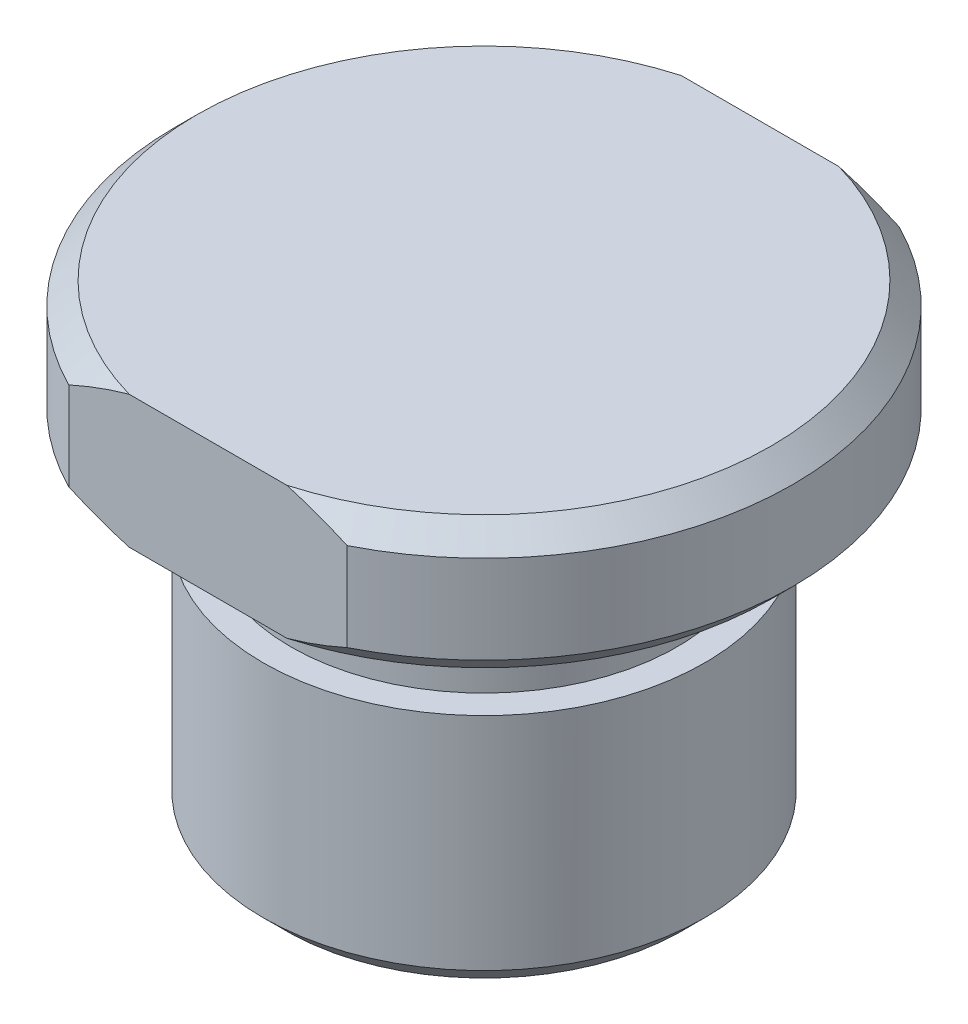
ISO-10303-21;
HEADER;
FILE_DESCRIPTION(('STEP AP214'),'2;1');
FILE_NAME('part.step','',(''),(''),'','','');
FILE_SCHEMA(('AUTOMOTIVE_DESIGN { 1 0 10303 214 1 1 1 1 }'));
ENDSEC;
DATA;
#1=APPLICATION_CONTEXT('core data for automotive mechanical design processes');
#2=APPLICATION_PROTOCOL_DEFINITION('international standard','automotive_design',2000,#1);
#3=PRODUCT_CONTEXT('',#1,'mechanical');
#4=PRODUCT('Part','Part','',(#3));
#5=PRODUCT_RELATED_PRODUCT_CATEGORY('part','',(#4));
#6=PRODUCT_DEFINITION_FORMATION('','',#4);
#7=PRODUCT_DEFINITION_CONTEXT('part definition',#1,'design');
#8=PRODUCT_DEFINITION('design','',#6,#7);
#9=PRODUCT_DEFINITION_SHAPE('','',#8);
#10=(LENGTH_UNIT() NAMED_UNIT(*) SI_UNIT(.MILLI.,.METRE.));
#11=(NAMED_UNIT(*) PLANE_ANGLE_UNIT() SI_UNIT($,.RADIAN.));
#12=(NAMED_UNIT(*) SI_UNIT($,.STERADIAN.) SOLID_ANGLE_UNIT());
#13=UNCERTAINTY_MEASURE_WITH_UNIT(LENGTH_MEASURE(1.E-05),#10,'distance_accuracy_value','');
#14=(GEOMETRIC_REPRESENTATION_CONTEXT(3) GLOBAL_UNCERTAINTY_ASSIGNED_CONTEXT((#13)) GLOBAL_UNIT_ASSIGNED_CONTEXT((#10,
#11,#12)) REPRESENTATION_CONTEXT('',''));
#15=CARTESIAN_POINT('',(0.,0.,0.));
#16=DIRECTION('',(0.,0.,1.));
#17=DIRECTION('',(1.,0.,0.));
#18=AXIS2_PLACEMENT_3D('',#15,#16,#17);
#19=CARTESIAN_POINT('',(0.,19.2193593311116,0.));
#20=DIRECTION('',(0.,1.,0.));
#21=DIRECTION('',(0.,0.,1.));
#22=AXIS2_PLACEMENT_3D('',#19,#20,#21);
#23=CYLINDRICAL_SURFACE('',#22,14.);
#24=DIRECTION('',(0.,1.,0.));
#25=VECTOR('',#24,1.);
#26=CARTESIAN_POINT('',(-6.30476010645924,-15.,-12.5));
#27=LINE('',#26,#25);
#28=CARTESIAN_POINT('',(-6.30476010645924,1.,-12.5));
#29=VERTEX_POINT('',#28);
#30=CARTESIAN_POINT('',(-6.30476010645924,5.,-12.5));
#31=VERTEX_POINT('',#30);
#32=EDGE_CURVE('E520',#29,#31,#27,.T.);
#33=ORIENTED_EDGE('',*,*,#32,.F.);
#34=CARTESIAN_POINT('',(0.,1.,0.));
#35=DIRECTION('',(0.,-1.,0.));
#36=DIRECTION('',(0.,0.,-1.));
#37=AXIS2_PLACEMENT_3D('',#34,#35,#36);
#38=CIRCLE('',#37,14.);
#39=CARTESIAN_POINT('',(-6.30476010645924,1.,12.5));
#40=VERTEX_POINT('',#39);
#41=EDGE_CURVE('E605',#29,#40,#38,.F.);
#42=ORIENTED_EDGE('',*,*,#41,.T.);
#43=DIRECTION('',(0.,1.,0.));
#44=VECTOR('',#43,1.);
#45=CARTESIAN_POINT('',(-6.30476010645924,-15.,12.5));
#46=LINE('',#45,#44);
#47=CARTESIAN_POINT('',(-6.30476010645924,5.,12.5));
#48=VERTEX_POINT('',#47);
#49=EDGE_CURVE('E560',#40,#48,#46,.T.);
#50=ORIENTED_EDGE('',*,*,#49,.T.);
#51=CARTESIAN_POINT('',(0.,4.99999999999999,0.));
#52=DIRECTION('',(0.,1.,0.));
#53=DIRECTION('',(0.,0.,1.));
#54=AXIS2_PLACEMENT_3D('',#51,#52,#53);
#55=CIRCLE('',#54,14.);
#56=EDGE_CURVE('E606',#48,#31,#55,.F.);
#57=ORIENTED_EDGE('',*,*,#56,.T.);
#58=EDGE_LOOP('',(#33,#42,#50,#57));
#59=FACE_BOUND('',#58,.T.);
#60=ADVANCED_FACE('F450',(#59),#23,.T.);
#61=CARTESIAN_POINT('',(0.,1.,0.));
#62=DIRECTION('',(0.,1.,0.));
#63=DIRECTION('',(0.,0.,1.));
#64=AXIS2_PLACEMENT_3D('',#61,#62,#63);
#65=CONICAL_SURFACE('',#64,14.,0.78539816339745);
#66=CARTESIAN_POINT('',(13.8944264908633,5.68970538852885,-12.5));
#67=CARTESIAN_POINT('',(13.7152136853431,5.55647654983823,-12.5));
#68=CARTESIAN_POINT('',(13.5354519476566,5.42398672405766,-12.5));
#69=CARTESIAN_POINT('',(13.1747372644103,5.1606303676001,-12.5));
#70=CARTESIAN_POINT('',(12.9937842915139,5.02976387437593,-12.5));
#71=CARTESIAN_POINT('',(12.4489023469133,4.63974875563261,-12.5));
#72=CARTESIAN_POINT('',(12.0830573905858,4.38326432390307,-12.5));
#73=CARTESIAN_POINT('',(11.3417667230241,3.87636756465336,-12.5));
#74=CARTESIAN_POINT('',(10.9662615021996,3.62604203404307,-12.5));
#75=CARTESIAN_POINT('',(10.2083070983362,3.13616722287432,-12.5));
#76=CARTESIAN_POINT('',(9.82585852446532,2.89661700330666,-12.5));
#77=CARTESIAN_POINT('',(9.03270264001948,2.41863588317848,-12.5));
#78=CARTESIAN_POINT('',(8.6215631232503,2.18091791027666,-12.5));
#79=CARTESIAN_POINT('',(7.78893953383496,1.72400806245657,-12.5));
#80=CARTESIAN_POINT('',(7.3674534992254,1.50481973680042,-12.5));
#81=CARTESIAN_POINT('',(6.51460488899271,1.09083627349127,-12.5));
#82=CARTESIAN_POINT('',(6.08328777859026,0.895948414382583,-12.5));
#83=CARTESIAN_POINT('',(5.20856500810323,0.535893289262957,-12.5));
#84=CARTESIAN_POINT('',(4.76516637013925,0.370709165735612,-12.5));
#85=CARTESIAN_POINT('',(3.89303118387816,0.0861177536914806,-12.5));
#86=CARTESIAN_POINT('',(3.46501191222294,-0.0354419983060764,-12.5));
#87=CARTESIAN_POINT('',(2.81607413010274,-0.188443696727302,-12.5));
#88=CARTESIAN_POINT('',(2.59856572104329,-0.234560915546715,-12.5));
#89=CARTESIAN_POINT('',(2.1615960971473,-0.316290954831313,-12.5));
#90=CARTESIAN_POINT('',(1.94213517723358,-0.351905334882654,-12.5));
#91=CARTESIAN_POINT('',(1.5056950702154,-0.411464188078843,-12.5));
#92=CARTESIAN_POINT('',(1.28874328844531,-0.435609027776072,-12.5));
#93=CARTESIAN_POINT('',(0.853911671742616,-0.472739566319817,-12.5));
#94=CARTESIAN_POINT('',(0.63603197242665,-0.485726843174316,-12.5));
#95=CARTESIAN_POINT('',(0.199887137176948,-0.500301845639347,-12.5));
#96=CARTESIAN_POINT('',(-0.0183780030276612,-0.501889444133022,-12.5));
#97=CARTESIAN_POINT('',(-0.454690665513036,-0.493635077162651,-12.5));
#98=CARTESIAN_POINT('',(-0.672738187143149,-0.483793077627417,-12.5));
#99=CARTESIAN_POINT('',(-1.10773275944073,-0.452885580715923,-12.5));
#100=CARTESIAN_POINT('',(-1.32468091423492,-0.431835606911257,-12.5));
#101=CARTESIAN_POINT('',(-1.7572627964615,-0.378913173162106,-12.5));
#102=CARTESIAN_POINT('',(-1.97289633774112,-0.347039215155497,-12.5));
#103=CARTESIAN_POINT('',(-2.61711880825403,-0.235962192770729,-12.5));
#104=CARTESIAN_POINT('',(-3.04310914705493,-0.141297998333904,-12.5));
#105=CARTESIAN_POINT('',(-3.89297847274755,0.0856469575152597,-12.5));
#106=CARTESIAN_POINT('',(-4.31667935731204,0.218578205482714,-12.5));
#107=CARTESIAN_POINT('',(-5.15316450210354,0.514882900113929,-12.5));
#108=CARTESIAN_POINT('',(-5.56594897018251,0.678255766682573,-12.5));
#109=CARTESIAN_POINT('',(-6.33785247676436,1.01107418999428,-12.5));
#110=CARTESIAN_POINT('',(-6.69804317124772,1.17806597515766,-12.5));
#111=CARTESIAN_POINT('',(-7.41051919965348,1.52823180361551,-12.5));
#112=CARTESIAN_POINT('',(-7.7628028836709,1.71140918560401,-12.5));
#113=CARTESIAN_POINT('',(-8.46065301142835,2.09128399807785,-12.5));
#114=CARTESIAN_POINT('',(-8.80620848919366,2.28800145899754,-12.5));
#115=CARTESIAN_POINT('',(-9.49082131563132,2.69233584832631,-12.5));
#116=CARTESIAN_POINT('',(-9.82987915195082,2.89995195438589,-12.5));
#117=CARTESIAN_POINT('',(-10.486269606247,3.31410932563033,-12.5));
#118=CARTESIAN_POINT('',(-10.8038679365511,3.52023101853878,-12.5));
#119=CARTESIAN_POINT('',(-11.4344932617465,3.93936713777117,-12.5));
#120=CARTESIAN_POINT('',(-11.747520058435,4.15238186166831,-12.5));
#121=CARTESIAN_POINT('',(-12.3682435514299,4.58333540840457,-12.5));
#122=CARTESIAN_POINT('',(-12.6759569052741,4.80125030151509,-12.5));
#123=CARTESIAN_POINT('',(-13.2877730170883,5.24199138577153,-12.5));
#124=CARTESIAN_POINT('',(-13.5918763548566,5.46481677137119,-12.5));
#125=CARTESIAN_POINT('',(-13.8944264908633,5.68970538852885,-12.5));
#126=B_SPLINE_CURVE_WITH_KNOTS('',3,(#66,#67,#68,#69,#70,#71,#72,#73,#74,#75,#76,#77,#78,#79,
#80,#81,#82,#83,#84,#85,#86,#87,#88,#89,#90,#91,#92,#93,#94,#95,#96,#97,#98,#99,#100,#101,#102,
#103,#104,#105,#106,#107,#108,#109,#110,#111,#112,#113,#114,#115,#116,#117,#118,#119,#120,#121,
#122,#123,#124,#125),.UNSPECIFIED.,.F.,.F.,(4,2,2,2,2,2,2,2,2,2,2,2,2,2,2,2,2,2,2,2,2,2,2,2,2,2,
2,2,2,4),(0.,0.669925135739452,1.33986569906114,2.68014736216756,4.03388293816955,
5.38750031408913,6.81186780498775,8.23650751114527,9.65553320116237,11.0737510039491,
12.4068475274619,13.0736634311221,13.7403802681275,14.3949775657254,15.0494822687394,
15.7039942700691,16.3585082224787,17.0121179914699,17.6658182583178,18.9729804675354,
20.303826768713,21.6346477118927,22.8252403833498,24.0160792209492,25.2087192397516,
26.4012693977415,27.5370333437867,28.6728463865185,29.8039753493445,30.9349201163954),.UNSPECIFIED.);
#127=CARTESIAN_POINT('',(6.30476010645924,1.,-12.5));
#128=VERTEX_POINT('',#127);
#129=CARTESIAN_POINT('',(3.5707142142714,0.,-12.5));
#130=VERTEX_POINT('',#129);
#131=EDGE_CURVE('E582',#128,#130,#126,.T.);
#132=ORIENTED_EDGE('',*,*,#131,.F.);
#133=CARTESIAN_POINT('',(6.30476010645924,1.,12.5));
#134=VERTEX_POINT('',#133);
#135=EDGE_CURVE('E603',#134,#128,#38,.F.);
#136=ORIENTED_EDGE('',*,*,#135,.F.);
#137=CARTESIAN_POINT('',(-13.8944264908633,5.68970538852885,12.5));
#138=CARTESIAN_POINT('',(-13.7152136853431,5.55647654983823,12.5));
#139=CARTESIAN_POINT('',(-13.5354519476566,5.42398672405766,12.5));
#140=CARTESIAN_POINT('',(-13.1747372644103,5.1606303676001,12.5));
#141=CARTESIAN_POINT('',(-12.9937842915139,5.02976387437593,12.5));
#142=CARTESIAN_POINT('',(-12.4489023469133,4.63974875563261,12.5));
#143=CARTESIAN_POINT('',(-12.0830573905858,4.38326432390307,12.5));
#144=CARTESIAN_POINT('',(-11.3417667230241,3.87636756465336,12.5));
#145=CARTESIAN_POINT('',(-10.9662615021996,3.62604203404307,12.5));
#146=CARTESIAN_POINT('',(-10.2083070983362,3.13616722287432,12.5));
#147=CARTESIAN_POINT('',(-9.82585852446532,2.89661700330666,12.5));
#148=CARTESIAN_POINT('',(-9.03270264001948,2.41863588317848,12.5));
#149=CARTESIAN_POINT('',(-8.6215631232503,2.18091791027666,12.5));
#150=CARTESIAN_POINT('',(-7.78893953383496,1.72400806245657,12.5));
#151=CARTESIAN_POINT('',(-7.3674534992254,1.50481973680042,12.5));
#152=CARTESIAN_POINT('',(-6.51460488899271,1.09083627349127,12.5));
#153=CARTESIAN_POINT('',(-6.08328777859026,0.895948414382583,12.5));
#154=CARTESIAN_POINT('',(-5.20856500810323,0.535893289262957,12.5));
#155=CARTESIAN_POINT('',(-4.76516637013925,0.370709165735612,12.5));
#156=CARTESIAN_POINT('',(-3.89303118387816,0.0861177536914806,12.5));
#157=CARTESIAN_POINT('',(-3.46501191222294,-0.0354419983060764,12.5));
#158=CARTESIAN_POINT('',(-2.81607413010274,-0.188443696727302,12.5));
#159=CARTESIAN_POINT('',(-2.59856572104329,-0.234560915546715,12.5));
#160=CARTESIAN_POINT('',(-2.1615960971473,-0.316290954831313,12.5));
#161=CARTESIAN_POINT('',(-1.94213517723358,-0.351905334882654,12.5));
#162=CARTESIAN_POINT('',(-1.5056950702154,-0.411464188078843,12.5));
#163=CARTESIAN_POINT('',(-1.28874328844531,-0.435609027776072,12.5));
#164=CARTESIAN_POINT('',(-0.853911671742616,-0.472739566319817,12.5));
#165=CARTESIAN_POINT('',(-0.63603197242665,-0.485726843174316,12.5));
#166=CARTESIAN_POINT('',(-0.199887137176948,-0.500301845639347,12.5));
#167=CARTESIAN_POINT('',(0.0183780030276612,-0.501889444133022,12.5));
#168=CARTESIAN_POINT('',(0.454690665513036,-0.493635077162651,12.5));
#169=CARTESIAN_POINT('',(0.672738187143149,-0.483793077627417,12.5));
#170=CARTESIAN_POINT('',(1.10773275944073,-0.452885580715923,12.5));
#171=CARTESIAN_POINT('',(1.32468091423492,-0.431835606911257,12.5));
#172=CARTESIAN_POINT('',(1.7572627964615,-0.378913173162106,12.5));
#173=CARTESIAN_POINT('',(1.97289633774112,-0.347039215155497,12.5));
#174=CARTESIAN_POINT('',(2.61711880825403,-0.235962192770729,12.5));
#175=CARTESIAN_POINT('',(3.04310914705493,-0.141297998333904,12.5));
#176=CARTESIAN_POINT('',(3.89297847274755,0.0856469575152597,12.5));
#177=CARTESIAN_POINT('',(4.31667935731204,0.218578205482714,12.5));
#178=CARTESIAN_POINT('',(5.15316450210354,0.514882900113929,12.5));
#179=CARTESIAN_POINT('',(5.56594897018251,0.678255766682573,12.5));
#180=CARTESIAN_POINT('',(6.33785247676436,1.01107418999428,12.5));
#181=CARTESIAN_POINT('',(6.69804317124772,1.17806597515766,12.5));
#182=CARTESIAN_POINT('',(7.41051919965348,1.52823180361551,12.5));
#183=CARTESIAN_POINT('',(7.7628028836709,1.71140918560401,12.5));
#184=CARTESIAN_POINT('',(8.46065301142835,2.09128399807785,12.5));
#185=CARTESIAN_POINT('',(8.80620848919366,2.28800145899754,12.5));
#186=CARTESIAN_POINT('',(9.49082131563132,2.69233584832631,12.5));
#187=CARTESIAN_POINT('',(9.82987915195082,2.89995195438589,12.5));
#188=CARTESIAN_POINT('',(10.486269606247,3.31410932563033,12.5));
#189=CARTESIAN_POINT('',(10.8038679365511,3.52023101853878,12.5));
#190=CARTESIAN_POINT('',(11.4344932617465,3.93936713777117,12.5));
#191=CARTESIAN_POINT('',(11.747520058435,4.15238186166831,12.5));
#192=CARTESIAN_POINT('',(12.3682435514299,4.58333540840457,12.5));
#193=CARTESIAN_POINT('',(12.6759569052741,4.80125030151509,12.5));
#194=CARTESIAN_POINT('',(13.2877730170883,5.24199138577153,12.5));
#195=CARTESIAN_POINT('',(13.5918763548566,5.46481677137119,12.5));
#196=CARTESIAN_POINT('',(13.8944264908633,5.68970538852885,12.5));
#197=B_SPLINE_CURVE_WITH_KNOTS('',3,(#137,#138,#139,#140,#141,#142,#143,#144,#145,#146,#147,
#148,#149,#150,#151,#152,#153,#154,#155,#156,#157,#158,#159,#160,#161,#162,#163,#164,#165,#166,
#167,#168,#169,#170,#171,#172,#173,#174,#175,#176,#177,#178,#179,#180,#181,#182,#183,#184,#185,
#186,#187,#188,#189,#190,#191,#192,#193,#194,#195,#196),.UNSPECIFIED.,.F.,.F.,(4,2,2,2,2,2,2,2,
2,2,2,2,2,2,2,2,2,2,2,2,2,2,2,2,2,2,2,2,2,4),(0.,0.669925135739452,1.33986569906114,
2.68014736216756,4.03388293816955,5.38750031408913,6.81186780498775,8.23650751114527,
9.65553320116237,11.0737510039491,12.4068475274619,13.0736634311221,13.7403802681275,
14.3949775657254,15.0494822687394,15.7039942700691,16.3585082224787,17.0121179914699,
17.6658182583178,18.9729804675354,20.303826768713,21.6346477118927,22.8252403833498,
24.0160792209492,25.2087192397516,26.4012693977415,27.5370333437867,28.6728463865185,
29.8039753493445,30.9349201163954),.UNSPECIFIED.);
#198=CARTESIAN_POINT('',(3.5707142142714,0.,12.5));
#199=VERTEX_POINT('',#198);
#200=EDGE_CURVE('E553',#199,#134,#197,.T.);
#201=ORIENTED_EDGE('',*,*,#200,.F.);
#202=CARTESIAN_POINT('',(0.,0.,0.));
#203=DIRECTION('',(0.,-1.,0.));
#204=DIRECTION('',(0.,0.,-1.));
#205=AXIS2_PLACEMENT_3D('',#202,#203,#204);
#206=CIRCLE('',#205,13.);
#207=EDGE_CURVE('E535',#130,#199,#206,.T.);
#208=ORIENTED_EDGE('',*,*,#207,.F.);
#209=EDGE_LOOP('',(#132,#136,#201,#208));
#210=FACE_BOUND('',#209,.T.);
#211=ADVANCED_FACE('F571',(#210),#65,.T.);
#212=CARTESIAN_POINT('',(0.,5.99999999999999,0.));
#213=DIRECTION('',(0.,-1.,0.));
#214=DIRECTION('',(0.,0.,-1.));
#215=AXIS2_PLACEMENT_3D('',#212,#213,#214);
#216=CONICAL_SURFACE('',#215,13.,0.785398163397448);
#217=CARTESIAN_POINT('',(-13.8944264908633,0.310294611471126,-12.5));
#218=CARTESIAN_POINT('',(-13.7152136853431,0.443523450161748,-12.5));
#219=CARTESIAN_POINT('',(-13.5354519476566,0.57601327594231,-12.5));
#220=CARTESIAN_POINT('',(-13.1747372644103,0.839369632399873,-12.5));
#221=CARTESIAN_POINT('',(-12.9937842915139,0.970236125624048,-12.5));
#222=CARTESIAN_POINT('',(-12.4489023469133,1.36025124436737,-12.5));
#223=CARTESIAN_POINT('',(-12.0830573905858,1.61673567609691,-12.5));
#224=CARTESIAN_POINT('',(-11.3417667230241,2.12363243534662,-12.5));
#225=CARTESIAN_POINT('',(-10.9662615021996,2.37395796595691,-12.5));
#226=CARTESIAN_POINT('',(-10.2083070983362,2.86383277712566,-12.5));
#227=CARTESIAN_POINT('',(-9.82585852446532,3.10338299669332,-12.5));
#228=CARTESIAN_POINT('',(-9.03270264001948,3.58136411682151,-12.5));
#229=CARTESIAN_POINT('',(-8.62156312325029,3.81908208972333,-12.5));
#230=CARTESIAN_POINT('',(-7.78893953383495,4.27599193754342,-12.5));
#231=CARTESIAN_POINT('',(-7.3674534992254,4.49518026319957,-12.5));
#232=CARTESIAN_POINT('',(-6.51460488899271,4.90916372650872,-12.5));
#233=CARTESIAN_POINT('',(-6.08328777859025,5.10405158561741,-12.5));
#234=CARTESIAN_POINT('',(-5.20856500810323,5.46410671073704,-12.5));
#235=CARTESIAN_POINT('',(-4.76516637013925,5.62929083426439,-12.5));
#236=CARTESIAN_POINT('',(-3.89303118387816,5.91388224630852,-12.5));
#237=CARTESIAN_POINT('',(-3.46501191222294,6.03544199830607,-12.5));
#238=CARTESIAN_POINT('',(-2.81607413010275,6.1884436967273,-12.5));
#239=CARTESIAN_POINT('',(-2.5985657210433,6.23456091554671,-12.5));
#240=CARTESIAN_POINT('',(-2.16159609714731,6.31629095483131,-12.5));
#241=CARTESIAN_POINT('',(-1.94213517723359,6.35190533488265,-12.5));
#242=CARTESIAN_POINT('',(-1.50569507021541,6.41146418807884,-12.5));
#243=CARTESIAN_POINT('',(-1.28874328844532,6.43560902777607,-12.5));
#244=CARTESIAN_POINT('',(-0.85391167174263,6.47273956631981,-12.5));
#245=CARTESIAN_POINT('',(-0.636031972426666,6.48572684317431,-12.5));
#246=CARTESIAN_POINT('',(-0.199887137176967,6.50030184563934,-12.5));
#247=CARTESIAN_POINT('',(0.0183780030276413,6.50188944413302,-12.5));
#248=CARTESIAN_POINT('',(0.454690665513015,6.49363507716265,-12.5));
#249=CARTESIAN_POINT('',(0.672738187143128,6.48379307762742,-12.5));
#250=CARTESIAN_POINT('',(1.10773275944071,6.45288558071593,-12.5));
#251=CARTESIAN_POINT('',(1.3246809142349,6.43183560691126,-12.5));
#252=CARTESIAN_POINT('',(1.75726279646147,6.3789131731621,-12.5));
#253=CARTESIAN_POINT('',(1.97289633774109,6.3470392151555,-12.5));
#254=CARTESIAN_POINT('',(2.617118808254,6.23596219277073,-12.5));
#255=CARTESIAN_POINT('',(3.0431091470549,6.14129799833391,-12.5));
#256=CARTESIAN_POINT('',(3.89297847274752,5.91435304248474,-12.5));
#257=CARTESIAN_POINT('',(4.31667935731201,5.78142179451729,-12.5));
#258=CARTESIAN_POINT('',(5.15316450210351,5.48511709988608,-12.5));
#259=CARTESIAN_POINT('',(5.56594897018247,5.32174423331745,-12.5));
#260=CARTESIAN_POINT('',(6.33785247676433,4.98892581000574,-12.5));
#261=CARTESIAN_POINT('',(6.69804317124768,4.82193402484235,-12.5));
#262=CARTESIAN_POINT('',(7.41051919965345,4.4717681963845,-12.5));
#263=CARTESIAN_POINT('',(7.76280288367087,4.288590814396,-12.5));
#264=CARTESIAN_POINT('',(8.46065301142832,3.90871600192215,-12.5));
#265=CARTESIAN_POINT('',(8.80620848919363,3.71199854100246,-12.5));
#266=CARTESIAN_POINT('',(9.4908213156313,3.30766415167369,-12.5));
#267=CARTESIAN_POINT('',(9.8298791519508,3.10004804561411,-12.5));
#268=CARTESIAN_POINT('',(10.486269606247,2.68589067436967,-12.5));
#269=CARTESIAN_POINT('',(10.8038679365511,2.47976898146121,-12.5));
#270=CARTESIAN_POINT('',(11.4344932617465,2.06063286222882,-12.5));
#271=CARTESIAN_POINT('',(11.747520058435,1.84761813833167,-12.5));
#272=CARTESIAN_POINT('',(12.3682435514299,1.41666459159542,-12.5));
#273=CARTESIAN_POINT('',(12.6759569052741,1.19874969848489,-12.5));
#274=CARTESIAN_POINT('',(13.2877730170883,0.758008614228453,-12.5));
#275=CARTESIAN_POINT('',(13.5918763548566,0.535183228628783,-12.5));
#276=CARTESIAN_POINT('',(13.8944264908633,0.310294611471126,-12.5));
#277=B_SPLINE_CURVE_WITH_KNOTS('',3,(#217,#218,#219,#220,#221,#222,#223,#224,#225,#226,#227,
#228,#229,#230,#231,#232,#233,#234,#235,#236,#237,#238,#239,#240,#241,#242,#243,#244,#245,#246,
#247,#248,#249,#250,#251,#252,#253,#254,#255,#256,#257,#258,#259,#260,#261,#262,#263,#264,#265,
#266,#267,#268,#269,#270,#271,#272,#273,#274,#275,#276),.UNSPECIFIED.,.F.,.F.,(4,2,2,2,2,2,2,2,
2,2,2,2,2,2,2,2,2,2,2,2,2,2,2,2,2,2,2,2,2,4),(0.,0.669925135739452,1.33986569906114,
2.68014736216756,4.03388293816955,5.38750031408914,6.81186780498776,8.23650751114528,
9.65553320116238,11.0737510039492,12.4068475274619,13.0736634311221,13.7403802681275,
14.3949775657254,15.0494822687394,15.7039942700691,16.3585082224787,17.0121179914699,
17.6658182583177,18.9729804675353,20.3038267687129,21.6346477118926,22.8252403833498,
24.0160792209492,25.2087192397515,26.4012693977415,27.5370333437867,28.6728463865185,
29.8039753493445,30.9349201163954),.UNSPECIFIED.);
#278=CARTESIAN_POINT('',(-3.57071421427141,6.00000000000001,-12.5));
#279=VERTEX_POINT('',#278);
#280=EDGE_CURVE('E11',#31,#279,#277,.T.);
#281=ORIENTED_EDGE('',*,*,#280,.F.);
#282=ORIENTED_EDGE('',*,*,#56,.F.);
#283=CARTESIAN_POINT('',(13.8944264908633,0.310294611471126,12.5));
#284=CARTESIAN_POINT('',(13.7152136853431,0.443523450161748,12.5));
#285=CARTESIAN_POINT('',(13.5354519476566,0.57601327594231,12.5));
#286=CARTESIAN_POINT('',(13.1747372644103,0.839369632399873,12.5));
#287=CARTESIAN_POINT('',(12.9937842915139,0.970236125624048,12.5));
#288=CARTESIAN_POINT('',(12.4489023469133,1.36025124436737,12.5));
#289=CARTESIAN_POINT('',(12.0830573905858,1.61673567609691,12.5));
#290=CARTESIAN_POINT('',(11.3417667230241,2.12363243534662,12.5));
#291=CARTESIAN_POINT('',(10.9662615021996,2.37395796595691,12.5));
#292=CARTESIAN_POINT('',(10.2083070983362,2.86383277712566,12.5));
#293=CARTESIAN_POINT('',(9.82585852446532,3.10338299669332,12.5));
#294=CARTESIAN_POINT('',(9.03270264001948,3.58136411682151,12.5));
#295=CARTESIAN_POINT('',(8.62156312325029,3.81908208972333,12.5));
#296=CARTESIAN_POINT('',(7.78893953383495,4.27599193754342,12.5));
#297=CARTESIAN_POINT('',(7.3674534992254,4.49518026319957,12.5));
#298=CARTESIAN_POINT('',(6.51460488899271,4.90916372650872,12.5));
#299=CARTESIAN_POINT('',(6.08328777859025,5.10405158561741,12.5));
#300=CARTESIAN_POINT('',(5.20856500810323,5.46410671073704,12.5));
#301=CARTESIAN_POINT('',(4.76516637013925,5.62929083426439,12.5));
#302=CARTESIAN_POINT('',(3.89303118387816,5.91388224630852,12.5));
#303=CARTESIAN_POINT('',(3.46501191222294,6.03544199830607,12.5));
#304=CARTESIAN_POINT('',(2.81607413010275,6.1884436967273,12.5));
#305=CARTESIAN_POINT('',(2.5985657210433,6.23456091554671,12.5));
#306=CARTESIAN_POINT('',(2.16159609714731,6.31629095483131,12.5));
#307=CARTESIAN_POINT('',(1.94213517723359,6.35190533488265,12.5));
#308=CARTESIAN_POINT('',(1.50569507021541,6.41146418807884,12.5));
#309=CARTESIAN_POINT('',(1.28874328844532,6.43560902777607,12.5));
#310=CARTESIAN_POINT('',(0.85391167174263,6.47273956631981,12.5));
#311=CARTESIAN_POINT('',(0.636031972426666,6.48572684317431,12.5));
#312=CARTESIAN_POINT('',(0.199887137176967,6.50030184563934,12.5));
#313=CARTESIAN_POINT('',(-0.0183780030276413,6.50188944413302,12.5));
#314=CARTESIAN_POINT('',(-0.454690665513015,6.49363507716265,12.5));
#315=CARTESIAN_POINT('',(-0.672738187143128,6.48379307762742,12.5));
#316=CARTESIAN_POINT('',(-1.10773275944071,6.45288558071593,12.5));
#317=CARTESIAN_POINT('',(-1.3246809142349,6.43183560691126,12.5));
#318=CARTESIAN_POINT('',(-1.75726279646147,6.3789131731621,12.5));
#319=CARTESIAN_POINT('',(-1.97289633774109,6.3470392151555,12.5));
#320=CARTESIAN_POINT('',(-2.617118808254,6.23596219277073,12.5));
#321=CARTESIAN_POINT('',(-3.0431091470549,6.14129799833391,12.5));
#322=CARTESIAN_POINT('',(-3.89297847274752,5.91435304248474,12.5));
#323=CARTESIAN_POINT('',(-4.31667935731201,5.78142179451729,12.5));
#324=CARTESIAN_POINT('',(-5.15316450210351,5.48511709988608,12.5));
#325=CARTESIAN_POINT('',(-5.56594897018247,5.32174423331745,12.5));
#326=CARTESIAN_POINT('',(-6.33785247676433,4.98892581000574,12.5));
#327=CARTESIAN_POINT('',(-6.69804317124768,4.82193402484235,12.5));
#328=CARTESIAN_POINT('',(-7.41051919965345,4.4717681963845,12.5));
#329=CARTESIAN_POINT('',(-7.76280288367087,4.288590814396,12.5));
#330=CARTESIAN_POINT('',(-8.46065301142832,3.90871600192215,12.5));
#331=CARTESIAN_POINT('',(-8.80620848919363,3.71199854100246,12.5));
#332=CARTESIAN_POINT('',(-9.4908213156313,3.30766415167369,12.5));
#333=CARTESIAN_POINT('',(-9.8298791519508,3.10004804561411,12.5));
#334=CARTESIAN_POINT('',(-10.486269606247,2.68589067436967,12.5));
#335=CARTESIAN_POINT('',(-10.8038679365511,2.47976898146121,12.5));
#336=CARTESIAN_POINT('',(-11.4344932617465,2.06063286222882,12.5));
#337=CARTESIAN_POINT('',(-11.747520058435,1.84761813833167,12.5));
#338=CARTESIAN_POINT('',(-12.3682435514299,1.41666459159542,12.5));
#339=CARTESIAN_POINT('',(-12.6759569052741,1.19874969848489,12.5));
#340=CARTESIAN_POINT('',(-13.2877730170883,0.758008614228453,12.5));
#341=CARTESIAN_POINT('',(-13.5918763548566,0.535183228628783,12.5));
#342=CARTESIAN_POINT('',(-13.8944264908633,0.310294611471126,12.5));
#343=B_SPLINE_CURVE_WITH_KNOTS('',3,(#283,#284,#285,#286,#287,#288,#289,#290,#291,#292,#293,
#294,#295,#296,#297,#298,#299,#300,#301,#302,#303,#304,#305,#306,#307,#308,#309,#310,#311,#312,
#313,#314,#315,#316,#317,#318,#319,#320,#321,#322,#323,#324,#325,#326,#327,#328,#329,#330,#331,
#332,#333,#334,#335,#336,#337,#338,#339,#340,#341,#342),.UNSPECIFIED.,.F.,.F.,(4,2,2,2,2,2,2,2,
2,2,2,2,2,2,2,2,2,2,2,2,2,2,2,2,2,2,2,2,2,4),(0.,0.669925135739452,1.33986569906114,
2.68014736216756,4.03388293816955,5.38750031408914,6.81186780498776,8.23650751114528,
9.65553320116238,11.0737510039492,12.4068475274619,13.0736634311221,13.7403802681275,
14.3949775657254,15.0494822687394,15.7039942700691,16.3585082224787,17.0121179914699,
17.6658182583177,18.9729804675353,20.3038267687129,21.6346477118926,22.8252403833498,
24.0160792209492,25.2087192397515,26.4012693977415,27.5370333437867,28.6728463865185,
29.8039753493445,30.9349201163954),.UNSPECIFIED.);
#344=CARTESIAN_POINT('',(-3.57071421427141,6.00000000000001,12.5));
#345=VERTEX_POINT('',#344);
#346=EDGE_CURVE('E531',#345,#48,#343,.T.);
#347=ORIENTED_EDGE('',*,*,#346,.F.);
#348=CARTESIAN_POINT('',(0.,6.00000000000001,0.));
#349=DIRECTION('',(0.,1.,0.));
#350=DIRECTION('',(0.,0.,1.));
#351=AXIS2_PLACEMENT_3D('',#348,#349,#350);
#352=CIRCLE('',#351,13.);
#353=EDGE_CURVE('E476',#279,#345,#352,.T.);
#354=ORIENTED_EDGE('',*,*,#353,.F.);
#355=EDGE_LOOP('',(#281,#282,#347,#354));
#356=FACE_BOUND('',#355,.T.);
#357=ADVANCED_FACE('F530',(#356),#216,.T.);
#358=CARTESIAN_POINT('',(0.,6.00000000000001,0.));
#359=DIRECTION('',(0.,1.,0.));
#360=DIRECTION('',(0.,0.,1.));
#361=AXIS2_PLACEMENT_3D('',#358,#359,#360);
#362=PLANE('',#361);
#363=DIRECTION('',(1.,0.,0.));
#364=VECTOR('',#363,1.);
#365=CARTESIAN_POINT('',(6.30476010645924,6.00000000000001,-12.5));
#366=LINE('',#365,#364);
#367=CARTESIAN_POINT('',(3.57071421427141,6.00000000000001,-12.5));
#368=VERTEX_POINT('',#367);
#369=EDGE_CURVE('E469',#279,#368,#366,.T.);
#370=ORIENTED_EDGE('',*,*,#369,.F.);
#371=ORIENTED_EDGE('',*,*,#353,.T.);
#372=DIRECTION('',(-1.,0.,0.));
#373=VECTOR('',#372,1.);
#374=CARTESIAN_POINT('',(6.30476010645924,6.00000000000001,12.5));
#375=LINE('',#374,#373);
#376=CARTESIAN_POINT('',(3.57071421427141,6.00000000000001,12.5));
#377=VERTEX_POINT('',#376);
#378=EDGE_CURVE('E585',#377,#345,#375,.T.);
#379=ORIENTED_EDGE('',*,*,#378,.F.);
#380=EDGE_CURVE('E526',#377,#368,#352,.T.);
#381=ORIENTED_EDGE('',*,*,#380,.T.);
#382=EDGE_LOOP('',(#370,#371,#379,#381));
#383=FACE_BOUND('',#382,.T.);
#384=ADVANCED_FACE('F452',(#383),#362,.T.);
#385=DIRECTION('',(0.,1.,0.));
#386=VECTOR('',#385,1.);
#387=CARTESIAN_POINT('',(6.30476010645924,-15.,-12.5));
#388=LINE('',#387,#386);
#389=CARTESIAN_POINT('',(6.30476010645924,5.,-12.5));
#390=VERTEX_POINT('',#389);
#391=EDGE_CURVE('E527',#128,#390,#388,.T.);
#392=ORIENTED_EDGE('',*,*,#391,.T.);
#393=CARTESIAN_POINT('',(6.30476010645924,5.,12.5));
#394=VERTEX_POINT('',#393);
#395=EDGE_CURVE('E599',#390,#394,#55,.F.);
#396=ORIENTED_EDGE('',*,*,#395,.T.);
#397=DIRECTION('',(0.,1.,0.));
#398=VECTOR('',#397,1.);
#399=CARTESIAN_POINT('',(6.30476010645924,-15.,12.5));
#400=LINE('',#399,#398);
#401=EDGE_CURVE('E562',#134,#394,#400,.T.);
#402=ORIENTED_EDGE('',*,*,#401,.F.);
#403=ORIENTED_EDGE('',*,*,#135,.T.);
#404=EDGE_LOOP('',(#392,#396,#402,#403));
#405=FACE_BOUND('',#404,.T.);
#406=ADVANCED_FACE('F602',(#405),#23,.T.);
#407=CARTESIAN_POINT('',(-10.,0.,0.));
#408=DIRECTION('',(0.,-1.,0.));
#409=DIRECTION('',(0.,0.,-1.));
#410=AXIS2_PLACEMENT_3D('',#407,#408,#409);
#411=PLANE('',#410);
#412=DIRECTION('',(-1.,0.,0.));
#413=VECTOR('',#412,1.);
#414=CARTESIAN_POINT('',(-10.,0.,-12.5));
#415=LINE('',#414,#413);
#416=CARTESIAN_POINT('',(-3.5707142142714,0.,-12.5));
#417=VERTEX_POINT('',#416);
#418=EDGE_CURVE('E581',#130,#417,#415,.T.);
#419=ORIENTED_EDGE('',*,*,#418,.F.);
#420=ORIENTED_EDGE('',*,*,#207,.T.);
#421=DIRECTION('',(1.,0.,0.));
#422=VECTOR('',#421,1.);
#423=CARTESIAN_POINT('',(-10.,0.,12.5));
#424=LINE('',#423,#422);
#425=CARTESIAN_POINT('',(-3.5707142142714,0.,12.5));
#426=VERTEX_POINT('',#425);
#427=EDGE_CURVE('E559',#426,#199,#424,.T.);
#428=ORIENTED_EDGE('',*,*,#427,.F.);
#429=EDGE_CURVE('E532',#426,#417,#206,.T.);
#430=ORIENTED_EDGE('',*,*,#429,.T.);
#431=EDGE_LOOP('',(#419,#420,#428,#430));
#432=FACE_BOUND('',#431,.T.);
#433=CARTESIAN_POINT('',(0.,0.,0.));
#434=DIRECTION('',(0.,1.,0.));
#435=DIRECTION('',(0.,0.,1.));
#436=AXIS2_PLACEMENT_3D('',#433,#434,#435);
#437=CIRCLE('',#436,8.75);
#438=CARTESIAN_POINT('',(0.,0.,8.75));
#439=VERTEX_POINT('',#438);
#440=EDGE_CURVE('E615',#439,#439,#437,.T.);
#441=ORIENTED_EDGE('',*,*,#440,.T.);
#442=EDGE_LOOP('',(#441));
#443=FACE_BOUND('',#442,.T.);
#444=ADVANCED_FACE('F630',(#432,#443),#411,.T.);
#445=CARTESIAN_POINT('',(0.,19.2193593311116,0.));
#446=DIRECTION('',(0.,1.,0.));
#447=DIRECTION('',(0.,0.,1.));
#448=AXIS2_PLACEMENT_3D('',#445,#446,#447);
#449=CYLINDRICAL_SURFACE('',#448,8.75);
#450=CARTESIAN_POINT('',(0.,-4.,0.));
#451=DIRECTION('',(0.,1.,0.));
#452=DIRECTION('',(0.,0.,1.));
#453=AXIS2_PLACEMENT_3D('',#450,#451,#452);
#454=CIRCLE('',#453,8.75);
#455=CARTESIAN_POINT('',(0.,-4.,8.75));
#456=VERTEX_POINT('',#455);
#457=EDGE_CURVE('E618',#456,#456,#454,.T.);
#458=ORIENTED_EDGE('',*,*,#457,.T.);
#459=EDGE_LOOP('',(#458));
#460=FACE_BOUND('',#459,.T.);
#461=ORIENTED_EDGE('',*,*,#440,.F.);
#462=EDGE_LOOP('',(#461));
#463=FACE_BOUND('',#462,.T.);
#464=ADVANCED_FACE('F644',(#460,#463),#449,.T.);
#465=CARTESIAN_POINT('',(-10.,-4.,0.));
#466=DIRECTION('',(0.,1.,0.));
#467=DIRECTION('',(0.,0.,1.));
#468=AXIS2_PLACEMENT_3D('',#465,#466,#467);
#469=PLANE('',#468);
#470=CARTESIAN_POINT('',(0.,-4.,0.));
#471=DIRECTION('',(0.,1.,0.));
#472=DIRECTION('',(0.,0.,1.));
#473=AXIS2_PLACEMENT_3D('',#470,#471,#472);
#474=CIRCLE('',#473,10.);
#475=CARTESIAN_POINT('',(0.,-4.,10.));
#476=VERTEX_POINT('',#475);
#477=EDGE_CURVE('E620',#476,#476,#474,.T.);
#478=ORIENTED_EDGE('',*,*,#477,.T.);
#479=EDGE_LOOP('',(#478));
#480=FACE_BOUND('',#479,.T.);
#481=ORIENTED_EDGE('',*,*,#457,.F.);
#482=EDGE_LOOP('',(#481));
#483=FACE_BOUND('',#482,.T.);
#484=ADVANCED_FACE('F694',(#480,#483),#469,.T.);
#485=CARTESIAN_POINT('',(0.,19.2193593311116,0.));
#486=DIRECTION('',(0.,1.,0.));
#487=DIRECTION('',(0.,0.,1.));
#488=AXIS2_PLACEMENT_3D('',#485,#486,#487);
#489=CYLINDRICAL_SURFACE('',#488,10.);
#490=CARTESIAN_POINT('',(0.,-14.,0.));
#491=DIRECTION('',(0.,-1.,0.));
#492=DIRECTION('',(0.,0.,-1.));
#493=AXIS2_PLACEMENT_3D('',#490,#491,#492);
#494=CIRCLE('',#493,10.);
#495=CARTESIAN_POINT('',(0.,-14.,-10.));
#496=VERTEX_POINT('',#495);
#497=EDGE_CURVE('E612',#496,#496,#494,.F.);
#498=ORIENTED_EDGE('',*,*,#497,.T.);
#499=EDGE_LOOP('',(#498));
#500=FACE_BOUND('',#499,.T.);
#501=ORIENTED_EDGE('',*,*,#477,.F.);
#502=EDGE_LOOP('',(#501));
#503=FACE_BOUND('',#502,.T.);
#504=ADVANCED_FACE('F687',(#500,#503),#489,.T.);
#505=CARTESIAN_POINT('',(-10.,-15.,0.));
#506=DIRECTION('',(0.,-1.,0.));
#507=DIRECTION('',(0.,0.,-1.));
#508=AXIS2_PLACEMENT_3D('',#505,#506,#507);
#509=PLANE('',#508);
#510=CARTESIAN_POINT('',(0.,-15.,0.));
#511=DIRECTION('',(0.,-1.,0.));
#512=DIRECTION('',(0.,0.,-1.));
#513=AXIS2_PLACEMENT_3D('',#510,#511,#512);
#514=CIRCLE('',#513,8.99999999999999);
#515=CARTESIAN_POINT('',(0.,-15.,-8.99999999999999));
#516=VERTEX_POINT('',#515);
#517=EDGE_CURVE('E609',#516,#516,#514,.T.);
#518=ORIENTED_EDGE('',*,*,#517,.T.);
#519=EDGE_LOOP('',(#518));
#520=FACE_BOUND('',#519,.T.);
#521=ADVANCED_FACE('F680',(#520),#509,.T.);
#522=CARTESIAN_POINT('',(0.,-14.,0.));
#523=DIRECTION('',(0.,1.,0.));
#524=DIRECTION('',(0.,0.,1.));
#525=AXIS2_PLACEMENT_3D('',#522,#523,#524);
#526=CONICAL_SURFACE('',#525,10.,0.785398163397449);
#527=ORIENTED_EDGE('',*,*,#517,.F.);
#528=EDGE_LOOP('',(#527));
#529=FACE_BOUND('',#528,.T.);
#530=ORIENTED_EDGE('',*,*,#497,.F.);
#531=EDGE_LOOP('',(#530));
#532=FACE_BOUND('',#531,.T.);
#533=ADVANCED_FACE('F569',(#529,#532),#526,.T.);
#534=EDGE_CURVE('E575',#417,#29,#126,.T.);
#535=ORIENTED_EDGE('',*,*,#534,.F.);
#536=ORIENTED_EDGE('',*,*,#429,.F.);
#537=EDGE_CURVE('E561',#40,#426,#197,.T.);
#538=ORIENTED_EDGE('',*,*,#537,.F.);
#539=ORIENTED_EDGE('',*,*,#41,.F.);
#540=EDGE_LOOP('',(#535,#536,#538,#539));
#541=FACE_BOUND('',#540,.T.);
#542=ADVANCED_FACE('F565',(#541),#65,.T.);
#543=EDGE_CURVE('E454',#368,#390,#277,.T.);
#544=ORIENTED_EDGE('',*,*,#543,.F.);
#545=ORIENTED_EDGE('',*,*,#380,.F.);
#546=EDGE_CURVE('E542',#394,#377,#343,.T.);
#547=ORIENTED_EDGE('',*,*,#546,.F.);
#548=ORIENTED_EDGE('',*,*,#395,.F.);
#549=EDGE_LOOP('',(#544,#545,#547,#548));
#550=FACE_BOUND('',#549,.T.);
#551=ADVANCED_FACE('F543',(#550),#216,.T.);
#552=CARTESIAN_POINT('',(6.30476010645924,-15.,12.5));
#553=DIRECTION('',(0.,0.,-1.));
#554=DIRECTION('',(-1.,0.,0.));
#555=AXIS2_PLACEMENT_3D('',#552,#553,#554);
#556=PLANE('',#555);
#557=ORIENTED_EDGE('',*,*,#537,.T.);
#558=ORIENTED_EDGE('',*,*,#427,.T.);
#559=ORIENTED_EDGE('',*,*,#200,.T.);
#560=ORIENTED_EDGE('',*,*,#401,.T.);
#561=ORIENTED_EDGE('',*,*,#546,.T.);
#562=ORIENTED_EDGE('',*,*,#378,.T.);
#563=ORIENTED_EDGE('',*,*,#346,.T.);
#564=ORIENTED_EDGE('',*,*,#49,.F.);
#565=EDGE_LOOP('',(#557,#558,#559,#560,#561,#562,#563,#564));
#566=FACE_BOUND('',#565,.T.);
#567=ADVANCED_FACE('F546',(#566),#556,.F.);
#568=CARTESIAN_POINT('',(6.30476010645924,-15.,-12.5));
#569=DIRECTION('',(0.,0.,1.));
#570=DIRECTION('',(1.,0.,0.));
#571=AXIS2_PLACEMENT_3D('',#568,#569,#570);
#572=PLANE('',#571);
#573=ORIENTED_EDGE('',*,*,#131,.T.);
#574=ORIENTED_EDGE('',*,*,#418,.T.);
#575=ORIENTED_EDGE('',*,*,#534,.T.);
#576=ORIENTED_EDGE('',*,*,#32,.T.);
#577=ORIENTED_EDGE('',*,*,#280,.T.);
#578=ORIENTED_EDGE('',*,*,#369,.T.);
#579=ORIENTED_EDGE('',*,*,#543,.T.);
#580=ORIENTED_EDGE('',*,*,#391,.F.);
#581=EDGE_LOOP('',(#573,#574,#575,#576,#577,#578,#579,#580));
#582=FACE_BOUND('',#581,.T.);
#583=ADVANCED_FACE('F518',(#582),#572,.F.);
#584=CLOSED_SHELL('',(#60,#211,#357,#384,#406,#444,#464,#484,#504,#521,#533,#542,#551,#567,#583));
#585=MANIFOLD_SOLID_BREP('B2',#584);
#586=ADVANCED_BREP_SHAPE_REPRESENTATION('',(#18,#585),#14);
#587=SHAPE_DEFINITION_REPRESENTATION(#9,#586);
ENDSEC;
END-ISO-10303-21;
